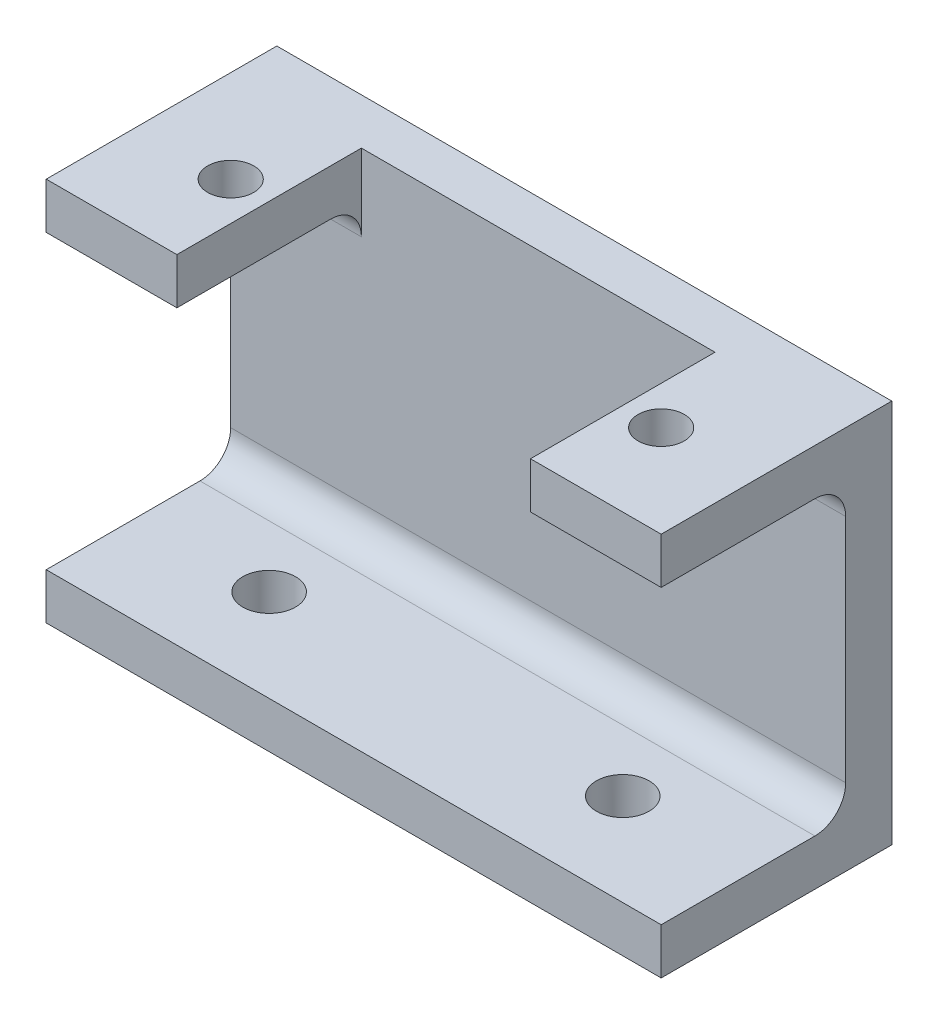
ISO-10303-21;
HEADER;
FILE_DESCRIPTION(('STEP AP214'),'2;1');
FILE_NAME('part.step','',(''),(''),'','','');
FILE_SCHEMA(('AUTOMOTIVE_DESIGN { 1 0 10303 214 1 1 1 1 }'));
ENDSEC;
DATA;
#1=APPLICATION_CONTEXT('core data for automotive mechanical design processes');
#2=APPLICATION_PROTOCOL_DEFINITION('international standard','automotive_design',2000,#1);
#3=PRODUCT_CONTEXT('',#1,'mechanical');
#4=PRODUCT('Part','Part','',(#3));
#5=PRODUCT_RELATED_PRODUCT_CATEGORY('part','',(#4));
#6=PRODUCT_DEFINITION_FORMATION('','',#4);
#7=PRODUCT_DEFINITION_CONTEXT('part definition',#1,'design');
#8=PRODUCT_DEFINITION('design','',#6,#7);
#9=PRODUCT_DEFINITION_SHAPE('','',#8);
#10=(LENGTH_UNIT() NAMED_UNIT(*) SI_UNIT(.MILLI.,.METRE.));
#11=(NAMED_UNIT(*) PLANE_ANGLE_UNIT() SI_UNIT($,.RADIAN.));
#12=(NAMED_UNIT(*) SI_UNIT($,.STERADIAN.) SOLID_ANGLE_UNIT());
#13=UNCERTAINTY_MEASURE_WITH_UNIT(LENGTH_MEASURE(1.E-05),#10,'distance_accuracy_value','');
#14=(GEOMETRIC_REPRESENTATION_CONTEXT(3) GLOBAL_UNCERTAINTY_ASSIGNED_CONTEXT((#13)) GLOBAL_UNIT_ASSIGNED_CONTEXT((#10,
#11,#12)) REPRESENTATION_CONTEXT('',''));
#15=CARTESIAN_POINT('',(0.,0.,0.));
#16=DIRECTION('',(0.,0.,1.));
#17=DIRECTION('',(1.,0.,0.));
#18=AXIS2_PLACEMENT_3D('',#15,#16,#17);
#19=CARTESIAN_POINT('',(0.,0.,3.));
#20=DIRECTION('',(0.,0.,1.));
#21=DIRECTION('',(1.,0.,0.));
#22=AXIS2_PLACEMENT_3D('',#19,#20,#21);
#23=PLANE('',#22);
#24=DIRECTION('',(0.,1.,0.));
#25=VECTOR('',#24,1.);
#26=CARTESIAN_POINT('',(-10.6343963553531,12.5740318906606,3.));
#27=LINE('',#26,#25);
#28=CARTESIAN_POINT('',(-10.6343963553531,7.57403189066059,3.));
#29=VERTEX_POINT('',#28);
#30=CARTESIAN_POINT('',(-10.6343963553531,12.5740318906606,3.));
#31=VERTEX_POINT('',#30);
#32=EDGE_CURVE('E181',#29,#31,#27,.T.);
#33=ORIENTED_EDGE('',*,*,#32,.F.);
#34=DIRECTION('',(1.,0.,0.));
#35=VECTOR('',#34,1.);
#36=CARTESIAN_POINT('',(0.,7.57403189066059,3.));
#37=LINE('',#36,#35);
#38=CARTESIAN_POINT('',(-19.1343963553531,7.57403189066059,3.));
#39=VERTEX_POINT('',#38);
#40=EDGE_CURVE('E248',#29,#39,#37,.F.);
#41=ORIENTED_EDGE('',*,*,#40,.T.);
#42=DIRECTION('',(0.,-1.,0.));
#43=VECTOR('',#42,1.);
#44=CARTESIAN_POINT('',(-19.1343963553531,12.5740318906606,3.));
#45=LINE('',#44,#43);
#46=CARTESIAN_POINT('',(-19.1343963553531,-7.42596810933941,3.));
#47=VERTEX_POINT('',#46);
#48=EDGE_CURVE('E219',#39,#47,#45,.T.);
#49=ORIENTED_EDGE('',*,*,#48,.T.);
#50=DIRECTION('',(-1.,0.,0.));
#51=VECTOR('',#50,1.);
#52=CARTESIAN_POINT('',(0.,-7.42596810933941,3.));
#53=LINE('',#52,#51);
#54=CARTESIAN_POINT('',(20.8656036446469,-7.42596810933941,3.));
#55=VERTEX_POINT('',#54);
#56=EDGE_CURVE('E243',#47,#55,#53,.F.);
#57=ORIENTED_EDGE('',*,*,#56,.T.);
#58=DIRECTION('',(0.,1.,0.));
#59=VECTOR('',#58,1.);
#60=CARTESIAN_POINT('',(20.8656036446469,12.5740318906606,3.));
#61=LINE('',#60,#59);
#62=CARTESIAN_POINT('',(20.8656036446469,7.57403189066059,3.));
#63=VERTEX_POINT('',#62);
#64=EDGE_CURVE('E222',#55,#63,#61,.T.);
#65=ORIENTED_EDGE('',*,*,#64,.T.);
#66=DIRECTION('',(1.,0.,0.));
#67=VECTOR('',#66,1.);
#68=CARTESIAN_POINT('',(0.,7.5740318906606,3.));
#69=LINE('',#68,#67);
#70=CARTESIAN_POINT('',(12.3656036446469,7.57403189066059,3.));
#71=VERTEX_POINT('',#70);
#72=EDGE_CURVE('E245',#63,#71,#69,.F.);
#73=ORIENTED_EDGE('',*,*,#72,.T.);
#74=DIRECTION('',(0.,-1.,0.));
#75=VECTOR('',#74,1.);
#76=CARTESIAN_POINT('',(12.3656036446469,12.5740318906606,3.));
#77=LINE('',#76,#75);
#78=CARTESIAN_POINT('',(12.3656036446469,12.5740318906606,3.));
#79=VERTEX_POINT('',#78);
#80=EDGE_CURVE('E166',#79,#71,#77,.T.);
#81=ORIENTED_EDGE('',*,*,#80,.F.);
#82=DIRECTION('',(-1.,0.,0.));
#83=VECTOR('',#82,1.);
#84=CARTESIAN_POINT('',(-19.1343963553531,12.5740318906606,3.));
#85=LINE('',#84,#83);
#86=EDGE_CURVE('E226',#79,#31,#85,.T.);
#87=ORIENTED_EDGE('',*,*,#86,.T.);
#88=EDGE_LOOP('',(#33,#41,#49,#57,#65,#73,#81,#87));
#89=FACE_BOUND('',#88,.T.);
#90=ADVANCED_FACE('F33',(#89),#23,.T.);
#91=CARTESIAN_POINT('',(-19.1343963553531,12.5740318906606,3.));
#92=DIRECTION('',(1.,0.,0.));
#93=DIRECTION('',(0.,1.,0.));
#94=AXIS2_PLACEMENT_3D('',#91,#92,#93);
#95=PLANE('',#94);
#96=DIRECTION('',(0.,-1.,0.));
#97=VECTOR('',#96,1.);
#98=CARTESIAN_POINT('',(-19.1343963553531,12.5740318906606,0.));
#99=LINE('',#98,#97);
#100=CARTESIAN_POINT('',(-19.1343963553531,12.5740318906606,0.));
#101=VERTEX_POINT('',#100);
#102=CARTESIAN_POINT('',(-19.1343963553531,-12.4259681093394,0.));
#103=VERTEX_POINT('',#102);
#104=EDGE_CURVE('E218',#101,#103,#99,.T.);
#105=ORIENTED_EDGE('',*,*,#104,.T.);
#106=DIRECTION('',(0.,0.,-1.));
#107=VECTOR('',#106,1.);
#108=CARTESIAN_POINT('',(-19.1343963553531,-12.4259681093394,3.));
#109=LINE('',#108,#107);
#110=CARTESIAN_POINT('',(-19.1343963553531,-12.4259681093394,15.));
#111=VERTEX_POINT('',#110);
#112=EDGE_CURVE('E237',#111,#103,#109,.T.);
#113=ORIENTED_EDGE('',*,*,#112,.F.);
#114=DIRECTION('',(0.,-1.,0.));
#115=VECTOR('',#114,1.);
#116=CARTESIAN_POINT('',(-19.1343963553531,-12.4259681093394,15.));
#117=LINE('',#116,#115);
#118=CARTESIAN_POINT('',(-19.1343963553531,-9.42596810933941,15.));
#119=VERTEX_POINT('',#118);
#120=EDGE_CURVE('E203',#119,#111,#117,.T.);
#121=ORIENTED_EDGE('',*,*,#120,.F.);
#122=DIRECTION('',(0.,0.,-1.));
#123=VECTOR('',#122,1.);
#124=CARTESIAN_POINT('',(-19.1343963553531,-9.42596810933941,15.));
#125=LINE('',#124,#123);
#126=CARTESIAN_POINT('',(-19.1343963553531,-9.42596810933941,5.));
#127=VERTEX_POINT('',#126);
#128=EDGE_CURVE('E213',#119,#127,#125,.T.);
#129=ORIENTED_EDGE('',*,*,#128,.T.);
#130=CARTESIAN_POINT('',(-19.1343963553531,-7.42596810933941,5.));
#131=DIRECTION('',(1.,0.,0.));
#132=DIRECTION('',(0.,1.,0.));
#133=AXIS2_PLACEMENT_3D('',#130,#131,#132);
#134=CIRCLE('',#133,2.);
#135=EDGE_CURVE('E41',#127,#47,#134,.T.);
#136=ORIENTED_EDGE('',*,*,#135,.T.);
#137=ORIENTED_EDGE('',*,*,#48,.F.);
#138=CARTESIAN_POINT('',(-19.1343963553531,7.57403189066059,5.));
#139=DIRECTION('',(1.,0.,0.));
#140=DIRECTION('',(0.,1.,0.));
#141=AXIS2_PLACEMENT_3D('',#138,#139,#140);
#142=CIRCLE('',#141,2.);
#143=CARTESIAN_POINT('',(-19.1343963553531,9.57403189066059,5.));
#144=VERTEX_POINT('',#143);
#145=EDGE_CURVE('E258',#39,#144,#142,.T.);
#146=ORIENTED_EDGE('',*,*,#145,.T.);
#147=DIRECTION('',(0.,0.,-1.));
#148=VECTOR('',#147,1.);
#149=CARTESIAN_POINT('',(-19.1343963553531,9.57403189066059,15.));
#150=LINE('',#149,#148);
#151=CARTESIAN_POINT('',(-19.1343963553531,9.57403189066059,15.));
#152=VERTEX_POINT('',#151);
#153=EDGE_CURVE('E200',#152,#144,#150,.T.);
#154=ORIENTED_EDGE('',*,*,#153,.F.);
#155=DIRECTION('',(0.,-1.,0.));
#156=VECTOR('',#155,1.);
#157=CARTESIAN_POINT('',(-19.1343963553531,12.5740318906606,15.));
#158=LINE('',#157,#156);
#159=CARTESIAN_POINT('',(-19.1343963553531,12.5740318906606,15.));
#160=VERTEX_POINT('',#159);
#161=EDGE_CURVE('E182',#160,#152,#158,.T.);
#162=ORIENTED_EDGE('',*,*,#161,.F.);
#163=DIRECTION('',(0.,0.,-1.));
#164=VECTOR('',#163,1.);
#165=CARTESIAN_POINT('',(-19.1343963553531,12.5740318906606,3.));
#166=LINE('',#165,#164);
#167=EDGE_CURVE('E151',#160,#101,#166,.T.);
#168=ORIENTED_EDGE('',*,*,#167,.T.);
#169=EDGE_LOOP('',(#105,#113,#121,#129,#136,#137,#146,#154,#162,#168));
#170=FACE_BOUND('',#169,.T.);
#171=ADVANCED_FACE('F265',(#170),#95,.F.);
#172=CARTESIAN_POINT('',(-19.1343963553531,-12.4259681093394,3.));
#173=DIRECTION('',(0.,1.,0.));
#174=DIRECTION('',(0.,0.,1.));
#175=AXIS2_PLACEMENT_3D('',#172,#173,#174);
#176=PLANE('',#175);
#177=CARTESIAN_POINT('',(12.3656036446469,-12.4259681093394,9.));
#178=DIRECTION('',(0.,1.,0.));
#179=DIRECTION('',(0.,0.,1.));
#180=AXIS2_PLACEMENT_3D('',#177,#178,#179);
#181=CIRCLE('',#180,1.71646895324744);
#182=CARTESIAN_POINT('',(12.3656036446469,-12.4259681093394,10.7164689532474));
#183=VERTEX_POINT('',#182);
#184=EDGE_CURVE('E336',#183,#183,#181,.F.);
#185=ORIENTED_EDGE('',*,*,#184,.F.);
#186=EDGE_LOOP('',(#185));
#187=FACE_BOUND('',#186,.T.);
#188=CARTESIAN_POINT('',(-10.6343963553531,-12.4259681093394,9.));
#189=DIRECTION('',(0.,1.,0.));
#190=DIRECTION('',(0.,0.,1.));
#191=AXIS2_PLACEMENT_3D('',#188,#189,#190);
#192=CIRCLE('',#191,1.71646895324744);
#193=CARTESIAN_POINT('',(-10.6343963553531,-12.4259681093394,10.7164689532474));
#194=VERTEX_POINT('',#193);
#195=EDGE_CURVE('E168',#194,#194,#192,.F.);
#196=ORIENTED_EDGE('',*,*,#195,.F.);
#197=EDGE_LOOP('',(#196));
#198=FACE_BOUND('',#197,.T.);
#199=DIRECTION('',(1.,0.,0.));
#200=VECTOR('',#199,1.);
#201=CARTESIAN_POINT('',(-19.1343963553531,-12.4259681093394,0.));
#202=LINE('',#201,#200);
#203=CARTESIAN_POINT('',(20.8656036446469,-12.4259681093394,0.));
#204=VERTEX_POINT('',#203);
#205=EDGE_CURVE('E230',#103,#204,#202,.T.);
#206=ORIENTED_EDGE('',*,*,#205,.T.);
#207=DIRECTION('',(0.,0.,-1.));
#208=VECTOR('',#207,1.);
#209=CARTESIAN_POINT('',(20.8656036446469,-12.4259681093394,3.));
#210=LINE('',#209,#208);
#211=CARTESIAN_POINT('',(20.8656036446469,-12.4259681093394,15.));
#212=VERTEX_POINT('',#211);
#213=EDGE_CURVE('E150',#212,#204,#210,.T.);
#214=ORIENTED_EDGE('',*,*,#213,.F.);
#215=DIRECTION('',(1.,0.,0.));
#216=VECTOR('',#215,1.);
#217=CARTESIAN_POINT('',(-19.1343963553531,-12.4259681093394,15.));
#218=LINE('',#217,#216);
#219=EDGE_CURVE('E206',#111,#212,#218,.T.);
#220=ORIENTED_EDGE('',*,*,#219,.F.);
#221=ORIENTED_EDGE('',*,*,#112,.T.);
#222=EDGE_LOOP('',(#206,#214,#220,#221));
#223=FACE_BOUND('',#222,.T.);
#224=ADVANCED_FACE('F279',(#187,#198,#223),#176,.F.);
#225=CARTESIAN_POINT('',(20.8656036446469,12.5740318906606,3.));
#226=DIRECTION('',(-1.,0.,0.));
#227=DIRECTION('',(0.,-1.,0.));
#228=AXIS2_PLACEMENT_3D('',#225,#226,#227);
#229=PLANE('',#228);
#230=DIRECTION('',(0.,1.,0.));
#231=VECTOR('',#230,1.);
#232=CARTESIAN_POINT('',(20.8656036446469,12.5740318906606,0.));
#233=LINE('',#232,#231);
#234=CARTESIAN_POINT('',(20.8656036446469,12.5740318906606,0.));
#235=VERTEX_POINT('',#234);
#236=EDGE_CURVE('E147',#204,#235,#233,.T.);
#237=ORIENTED_EDGE('',*,*,#236,.T.);
#238=DIRECTION('',(0.,0.,-1.));
#239=VECTOR('',#238,1.);
#240=CARTESIAN_POINT('',(20.8656036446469,12.5740318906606,3.));
#241=LINE('',#240,#239);
#242=CARTESIAN_POINT('',(20.8656036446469,12.5740318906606,15.));
#243=VERTEX_POINT('',#242);
#244=EDGE_CURVE('E139',#243,#235,#241,.T.);
#245=ORIENTED_EDGE('',*,*,#244,.F.);
#246=DIRECTION('',(0.,1.,0.));
#247=VECTOR('',#246,1.);
#248=CARTESIAN_POINT('',(20.8656036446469,12.5740318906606,15.));
#249=LINE('',#248,#247);
#250=CARTESIAN_POINT('',(20.8656036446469,9.57403189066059,15.));
#251=VERTEX_POINT('',#250);
#252=EDGE_CURVE('E144',#251,#243,#249,.T.);
#253=ORIENTED_EDGE('',*,*,#252,.F.);
#254=DIRECTION('',(0.,0.,-1.));
#255=VECTOR('',#254,1.);
#256=CARTESIAN_POINT('',(20.8656036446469,9.57403189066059,15.));
#257=LINE('',#256,#255);
#258=CARTESIAN_POINT('',(20.8656036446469,9.57403189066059,5.));
#259=VERTEX_POINT('',#258);
#260=EDGE_CURVE('E174',#251,#259,#257,.T.);
#261=ORIENTED_EDGE('',*,*,#260,.T.);
#262=CARTESIAN_POINT('',(20.8656036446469,7.57403189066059,5.));
#263=DIRECTION('',(-1.,0.,0.));
#264=DIRECTION('',(0.,-1.,0.));
#265=AXIS2_PLACEMENT_3D('',#262,#263,#264);
#266=CIRCLE('',#265,2.);
#267=EDGE_CURVE('E260',#259,#63,#266,.T.);
#268=ORIENTED_EDGE('',*,*,#267,.T.);
#269=ORIENTED_EDGE('',*,*,#64,.F.);
#270=CARTESIAN_POINT('',(20.8656036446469,-7.42596810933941,5.));
#271=DIRECTION('',(-1.,0.,0.));
#272=DIRECTION('',(0.,-1.,0.));
#273=AXIS2_PLACEMENT_3D('',#270,#271,#272);
#274=CIRCLE('',#273,2.);
#275=CARTESIAN_POINT('',(20.8656036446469,-9.42596810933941,5.));
#276=VERTEX_POINT('',#275);
#277=EDGE_CURVE('E11',#55,#276,#274,.T.);
#278=ORIENTED_EDGE('',*,*,#277,.T.);
#279=DIRECTION('',(0.,0.,-1.));
#280=VECTOR('',#279,1.);
#281=CARTESIAN_POINT('',(20.8656036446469,-9.42596810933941,15.));
#282=LINE('',#281,#280);
#283=CARTESIAN_POINT('',(20.8656036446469,-9.42596810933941,15.));
#284=VERTEX_POINT('',#283);
#285=EDGE_CURVE('E216',#284,#276,#282,.T.);
#286=ORIENTED_EDGE('',*,*,#285,.F.);
#287=DIRECTION('',(0.,1.,0.));
#288=VECTOR('',#287,1.);
#289=CARTESIAN_POINT('',(20.8656036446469,-12.4259681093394,15.));
#290=LINE('',#289,#288);
#291=EDGE_CURVE('E209',#212,#284,#290,.T.);
#292=ORIENTED_EDGE('',*,*,#291,.F.);
#293=ORIENTED_EDGE('',*,*,#213,.T.);
#294=EDGE_LOOP('',(#237,#245,#253,#261,#268,#269,#278,#286,#292,#293));
#295=FACE_BOUND('',#294,.T.);
#296=ADVANCED_FACE('F141',(#295),#229,.F.);
#297=CARTESIAN_POINT('',(-19.1343963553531,12.5740318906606,3.));
#298=DIRECTION('',(0.,-1.,0.));
#299=DIRECTION('',(0.,0.,-1.));
#300=AXIS2_PLACEMENT_3D('',#297,#298,#299);
#301=PLANE('',#300);
#302=CARTESIAN_POINT('',(14.8656036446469,12.5740318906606,9.));
#303=DIRECTION('',(0.,1.,0.));
#304=DIRECTION('',(0.,0.,-1.));
#305=AXIS2_PLACEMENT_3D('',#302,#303,#304);
#306=CIRCLE('',#305,1.5);
#307=CARTESIAN_POINT('',(14.8656036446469,12.5740318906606,7.5));
#308=VERTEX_POINT('',#307);
#309=EDGE_CURVE('E356',#308,#308,#306,.T.);
#310=ORIENTED_EDGE('',*,*,#309,.F.);
#311=EDGE_LOOP('',(#310));
#312=FACE_BOUND('',#311,.T.);
#313=CARTESIAN_POINT('',(-13.1343963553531,12.5740318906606,9.));
#314=DIRECTION('',(0.,1.,0.));
#315=DIRECTION('',(0.,0.,1.));
#316=AXIS2_PLACEMENT_3D('',#313,#314,#315);
#317=CIRCLE('',#316,1.5);
#318=CARTESIAN_POINT('',(-13.1343963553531,12.5740318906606,10.5));
#319=VERTEX_POINT('',#318);
#320=EDGE_CURVE('E350',#319,#319,#317,.T.);
#321=ORIENTED_EDGE('',*,*,#320,.F.);
#322=EDGE_LOOP('',(#321));
#323=FACE_BOUND('',#322,.T.);
#324=DIRECTION('',(-1.,0.,0.));
#325=VECTOR('',#324,1.);
#326=CARTESIAN_POINT('',(-19.1343963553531,12.5740318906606,0.));
#327=LINE('',#326,#325);
#328=EDGE_CURVE('E223',#235,#101,#327,.T.);
#329=ORIENTED_EDGE('',*,*,#328,.T.);
#330=ORIENTED_EDGE('',*,*,#167,.F.);
#331=DIRECTION('',(-1.,0.,0.));
#332=VECTOR('',#331,1.);
#333=CARTESIAN_POINT('',(-19.1343963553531,12.5740318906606,15.));
#334=LINE('',#333,#332);
#335=CARTESIAN_POINT('',(-10.6343963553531,12.5740318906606,15.));
#336=VERTEX_POINT('',#335);
#337=EDGE_CURVE('E189',#336,#160,#334,.T.);
#338=ORIENTED_EDGE('',*,*,#337,.F.);
#339=DIRECTION('',(0.,0.,-1.));
#340=VECTOR('',#339,1.);
#341=CARTESIAN_POINT('',(-10.6343963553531,12.5740318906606,15.));
#342=LINE('',#341,#340);
#343=EDGE_CURVE('E192',#336,#31,#342,.T.);
#344=ORIENTED_EDGE('',*,*,#343,.T.);
#345=ORIENTED_EDGE('',*,*,#86,.F.);
#346=DIRECTION('',(0.,0.,-1.));
#347=VECTOR('',#346,1.);
#348=CARTESIAN_POINT('',(12.3656036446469,12.5740318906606,15.));
#349=LINE('',#348,#347);
#350=CARTESIAN_POINT('',(12.3656036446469,12.5740318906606,15.));
#351=VERTEX_POINT('',#350);
#352=EDGE_CURVE('E157',#351,#79,#349,.T.);
#353=ORIENTED_EDGE('',*,*,#352,.F.);
#354=DIRECTION('',(-1.,0.,0.));
#355=VECTOR('',#354,1.);
#356=CARTESIAN_POINT('',(20.8656036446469,12.5740318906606,15.));
#357=LINE('',#356,#355);
#358=EDGE_CURVE('E154',#243,#351,#357,.T.);
#359=ORIENTED_EDGE('',*,*,#358,.F.);
#360=ORIENTED_EDGE('',*,*,#244,.T.);
#361=EDGE_LOOP('',(#329,#330,#338,#344,#345,#353,#359,#360));
#362=FACE_BOUND('',#361,.T.);
#363=ADVANCED_FACE('F155',(#312,#323,#362),#301,.F.);
#364=CARTESIAN_POINT('',(0.,0.,0.));
#365=DIRECTION('',(0.,0.,1.));
#366=DIRECTION('',(1.,0.,0.));
#367=AXIS2_PLACEMENT_3D('',#364,#365,#366);
#368=PLANE('',#367);
#369=ORIENTED_EDGE('',*,*,#104,.F.);
#370=ORIENTED_EDGE('',*,*,#328,.F.);
#371=ORIENTED_EDGE('',*,*,#236,.F.);
#372=ORIENTED_EDGE('',*,*,#205,.F.);
#373=EDGE_LOOP('',(#369,#370,#371,#372));
#374=FACE_BOUND('',#373,.T.);
#375=ADVANCED_FACE('F282',(#374),#368,.F.);
#376=CARTESIAN_POINT('',(-19.1343963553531,-9.42596810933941,15.));
#377=DIRECTION('',(0.,-1.,0.));
#378=DIRECTION('',(0.,0.,-1.));
#379=AXIS2_PLACEMENT_3D('',#376,#377,#378);
#380=PLANE('',#379);
#381=CARTESIAN_POINT('',(12.3656036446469,-9.42596810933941,9.));
#382=DIRECTION('',(0.,1.,0.));
#383=DIRECTION('',(0.,0.,-1.));
#384=AXIS2_PLACEMENT_3D('',#381,#382,#383);
#385=CIRCLE('',#384,1.71646895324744);
#386=CARTESIAN_POINT('',(12.3656036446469,-9.42596810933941,7.28353104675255));
#387=VERTEX_POINT('',#386);
#388=EDGE_CURVE('E344',#387,#387,#385,.T.);
#389=ORIENTED_EDGE('',*,*,#388,.F.);
#390=EDGE_LOOP('',(#389));
#391=FACE_BOUND('',#390,.T.);
#392=CARTESIAN_POINT('',(-10.6343963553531,-9.42596810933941,9.));
#393=DIRECTION('',(0.,1.,0.));
#394=DIRECTION('',(0.,0.,1.));
#395=AXIS2_PLACEMENT_3D('',#392,#393,#394);
#396=CIRCLE('',#395,1.71646895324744);
#397=CARTESIAN_POINT('',(-10.6343963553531,-9.42596810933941,10.7164689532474));
#398=VERTEX_POINT('',#397);
#399=EDGE_CURVE('E340',#398,#398,#396,.T.);
#400=ORIENTED_EDGE('',*,*,#399,.F.);
#401=EDGE_LOOP('',(#400));
#402=FACE_BOUND('',#401,.T.);
#403=ORIENTED_EDGE('',*,*,#285,.T.);
#404=DIRECTION('',(-1.,0.,0.));
#405=VECTOR('',#404,1.);
#406=CARTESIAN_POINT('',(-19.1343963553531,-9.42596810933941,5.));
#407=LINE('',#406,#405);
#408=EDGE_CURVE('E253',#276,#127,#407,.T.);
#409=ORIENTED_EDGE('',*,*,#408,.T.);
#410=ORIENTED_EDGE('',*,*,#128,.F.);
#411=DIRECTION('',(-1.,0.,0.));
#412=VECTOR('',#411,1.);
#413=CARTESIAN_POINT('',(-19.1343963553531,-9.42596810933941,15.));
#414=LINE('',#413,#412);
#415=EDGE_CURVE('E211',#284,#119,#414,.T.);
#416=ORIENTED_EDGE('',*,*,#415,.F.);
#417=EDGE_LOOP('',(#403,#409,#410,#416));
#418=FACE_BOUND('',#417,.T.);
#419=ADVANCED_FACE('F272',(#391,#402,#418),#380,.F.);
#420=CARTESIAN_POINT('',(0.,0.,15.));
#421=DIRECTION('',(0.,0.,-1.));
#422=DIRECTION('',(-1.,0.,0.));
#423=AXIS2_PLACEMENT_3D('',#420,#421,#422);
#424=PLANE('',#423);
#425=ORIENTED_EDGE('',*,*,#120,.T.);
#426=ORIENTED_EDGE('',*,*,#219,.T.);
#427=ORIENTED_EDGE('',*,*,#291,.T.);
#428=ORIENTED_EDGE('',*,*,#415,.T.);
#429=EDGE_LOOP('',(#425,#426,#427,#428));
#430=FACE_BOUND('',#429,.T.);
#431=ADVANCED_FACE('F276',(#430),#424,.F.);
#432=CARTESIAN_POINT('',(-19.1343963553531,9.57403189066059,15.));
#433=DIRECTION('',(0.,1.,0.));
#434=DIRECTION('',(0.,0.,1.));
#435=AXIS2_PLACEMENT_3D('',#432,#433,#434);
#436=PLANE('',#435);
#437=CARTESIAN_POINT('',(-13.1343963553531,9.57403189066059,9.));
#438=DIRECTION('',(0.,1.,0.));
#439=DIRECTION('',(0.,0.,1.));
#440=AXIS2_PLACEMENT_3D('',#437,#438,#439);
#441=CIRCLE('',#440,1.5);
#442=CARTESIAN_POINT('',(-13.1343963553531,9.57403189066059,10.5));
#443=VERTEX_POINT('',#442);
#444=EDGE_CURVE('E349',#443,#443,#441,.F.);
#445=ORIENTED_EDGE('',*,*,#444,.F.);
#446=EDGE_LOOP('',(#445));
#447=FACE_BOUND('',#446,.T.);
#448=ORIENTED_EDGE('',*,*,#153,.T.);
#449=DIRECTION('',(1.,0.,0.));
#450=VECTOR('',#449,1.);
#451=CARTESIAN_POINT('',(-19.1343963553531,9.57403189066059,5.));
#452=LINE('',#451,#450);
#453=CARTESIAN_POINT('',(-10.6343963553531,9.57403189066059,5.));
#454=VERTEX_POINT('',#453);
#455=EDGE_CURVE('E240',#144,#454,#452,.T.);
#456=ORIENTED_EDGE('',*,*,#455,.T.);
#457=DIRECTION('',(0.,0.,-1.));
#458=VECTOR('',#457,1.);
#459=CARTESIAN_POINT('',(-10.6343963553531,9.57403189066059,15.));
#460=LINE('',#459,#458);
#461=CARTESIAN_POINT('',(-10.6343963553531,9.57403189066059,15.));
#462=VERTEX_POINT('',#461);
#463=EDGE_CURVE('E197',#462,#454,#460,.T.);
#464=ORIENTED_EDGE('',*,*,#463,.F.);
#465=DIRECTION('',(1.,0.,0.));
#466=VECTOR('',#465,1.);
#467=CARTESIAN_POINT('',(-19.1343963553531,9.57403189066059,15.));
#468=LINE('',#467,#466);
#469=EDGE_CURVE('E185',#152,#462,#468,.T.);
#470=ORIENTED_EDGE('',*,*,#469,.F.);
#471=EDGE_LOOP('',(#448,#456,#464,#470));
#472=FACE_BOUND('',#471,.T.);
#473=ADVANCED_FACE('F378',(#447,#472),#436,.F.);
#474=CARTESIAN_POINT('',(-10.6343963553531,12.5740318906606,15.));
#475=DIRECTION('',(-1.,0.,0.));
#476=DIRECTION('',(0.,0.,1.));
#477=AXIS2_PLACEMENT_3D('',#474,#475,#476);
#478=PLANE('',#477);
#479=ORIENTED_EDGE('',*,*,#32,.T.);
#480=ORIENTED_EDGE('',*,*,#343,.F.);
#481=DIRECTION('',(0.,1.,0.));
#482=VECTOR('',#481,1.);
#483=CARTESIAN_POINT('',(-10.6343963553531,12.5740318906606,15.));
#484=LINE('',#483,#482);
#485=EDGE_CURVE('E187',#462,#336,#484,.T.);
#486=ORIENTED_EDGE('',*,*,#485,.F.);
#487=ORIENTED_EDGE('',*,*,#463,.T.);
#488=CARTESIAN_POINT('',(-10.6343963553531,7.57403189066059,5.));
#489=DIRECTION('',(-1.,0.,0.));
#490=DIRECTION('',(0.,0.,1.));
#491=AXIS2_PLACEMENT_3D('',#488,#489,#490);
#492=CIRCLE('',#491,2.);
#493=EDGE_CURVE('E255',#454,#29,#492,.T.);
#494=ORIENTED_EDGE('',*,*,#493,.T.);
#495=EDGE_LOOP('',(#479,#480,#486,#487,#494));
#496=FACE_BOUND('',#495,.T.);
#497=ADVANCED_FACE('F293',(#496),#478,.F.);
#498=CARTESIAN_POINT('',(0.,0.,15.));
#499=DIRECTION('',(0.,0.,1.));
#500=DIRECTION('',(1.,0.,0.));
#501=AXIS2_PLACEMENT_3D('',#498,#499,#500);
#502=PLANE('',#501);
#503=ORIENTED_EDGE('',*,*,#161,.T.);
#504=ORIENTED_EDGE('',*,*,#469,.T.);
#505=ORIENTED_EDGE('',*,*,#485,.T.);
#506=ORIENTED_EDGE('',*,*,#337,.T.);
#507=EDGE_LOOP('',(#503,#504,#505,#506));
#508=FACE_BOUND('',#507,.T.);
#509=ADVANCED_FACE('F287',(#508),#502,.T.);
#510=CARTESIAN_POINT('',(12.3656036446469,12.5740318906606,15.));
#511=DIRECTION('',(1.,0.,0.));
#512=DIRECTION('',(0.,0.,-1.));
#513=AXIS2_PLACEMENT_3D('',#510,#511,#512);
#514=PLANE('',#513);
#515=ORIENTED_EDGE('',*,*,#80,.T.);
#516=CARTESIAN_POINT('',(12.3656036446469,7.57403189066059,5.));
#517=DIRECTION('',(1.,0.,0.));
#518=DIRECTION('',(0.,0.,-1.));
#519=AXIS2_PLACEMENT_3D('',#516,#517,#518);
#520=CIRCLE('',#519,2.);
#521=CARTESIAN_POINT('',(12.3656036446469,9.57403189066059,5.));
#522=VERTEX_POINT('',#521);
#523=EDGE_CURVE('E262',#71,#522,#520,.T.);
#524=ORIENTED_EDGE('',*,*,#523,.T.);
#525=DIRECTION('',(0.,0.,-1.));
#526=VECTOR('',#525,1.);
#527=CARTESIAN_POINT('',(12.3656036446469,9.57403189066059,15.));
#528=LINE('',#527,#526);
#529=CARTESIAN_POINT('',(12.3656036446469,9.57403189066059,15.));
#530=VERTEX_POINT('',#529);
#531=EDGE_CURVE('E177',#530,#522,#528,.T.);
#532=ORIENTED_EDGE('',*,*,#531,.F.);
#533=DIRECTION('',(0.,-1.,0.));
#534=VECTOR('',#533,1.);
#535=CARTESIAN_POINT('',(12.3656036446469,12.5740318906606,15.));
#536=LINE('',#535,#534);
#537=EDGE_CURVE('E160',#351,#530,#536,.T.);
#538=ORIENTED_EDGE('',*,*,#537,.F.);
#539=ORIENTED_EDGE('',*,*,#352,.T.);
#540=EDGE_LOOP('',(#515,#524,#532,#538,#539));
#541=FACE_BOUND('',#540,.T.);
#542=ADVANCED_FACE('F297',(#541),#514,.F.);
#543=CARTESIAN_POINT('',(20.8656036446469,9.57403189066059,15.));
#544=DIRECTION('',(0.,1.,0.));
#545=DIRECTION('',(-1.,0.,0.));
#546=AXIS2_PLACEMENT_3D('',#543,#544,#545);
#547=PLANE('',#546);
#548=CARTESIAN_POINT('',(14.8656036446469,9.57403189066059,9.));
#549=DIRECTION('',(0.,1.,0.));
#550=DIRECTION('',(-1.,0.,0.));
#551=AXIS2_PLACEMENT_3D('',#548,#549,#550);
#552=CIRCLE('',#551,1.5);
#553=CARTESIAN_POINT('',(13.3656036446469,9.57403189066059,9.));
#554=VERTEX_POINT('',#553);
#555=EDGE_CURVE('E353',#554,#554,#552,.F.);
#556=ORIENTED_EDGE('',*,*,#555,.F.);
#557=EDGE_LOOP('',(#556));
#558=FACE_BOUND('',#557,.T.);
#559=ORIENTED_EDGE('',*,*,#531,.T.);
#560=DIRECTION('',(1.,0.,0.));
#561=VECTOR('',#560,1.);
#562=CARTESIAN_POINT('',(20.8656036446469,9.57403189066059,5.));
#563=LINE('',#562,#561);
#564=EDGE_CURVE('E250',#522,#259,#563,.T.);
#565=ORIENTED_EDGE('',*,*,#564,.T.);
#566=ORIENTED_EDGE('',*,*,#260,.F.);
#567=DIRECTION('',(1.,0.,0.));
#568=VECTOR('',#567,1.);
#569=CARTESIAN_POINT('',(20.8656036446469,9.57403189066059,15.));
#570=LINE('',#569,#568);
#571=EDGE_CURVE('E164',#530,#251,#570,.T.);
#572=ORIENTED_EDGE('',*,*,#571,.F.);
#573=EDGE_LOOP('',(#559,#565,#566,#572));
#574=FACE_BOUND('',#573,.T.);
#575=ADVANCED_FACE('F301',(#558,#574),#547,.F.);
#576=CARTESIAN_POINT('',(0.,0.,15.));
#577=DIRECTION('',(0.,0.,-1.));
#578=DIRECTION('',(-1.,0.,0.));
#579=AXIS2_PLACEMENT_3D('',#576,#577,#578);
#580=PLANE('',#579);
#581=ORIENTED_EDGE('',*,*,#252,.T.);
#582=ORIENTED_EDGE('',*,*,#358,.T.);
#583=ORIENTED_EDGE('',*,*,#537,.T.);
#584=ORIENTED_EDGE('',*,*,#571,.T.);
#585=EDGE_LOOP('',(#581,#582,#583,#584));
#586=FACE_BOUND('',#585,.T.);
#587=ADVANCED_FACE('F162',(#586),#580,.F.);
#588=CARTESIAN_POINT('',(-10.6343963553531,-12.4269681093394,9.));
#589=DIRECTION('',(0.,1.,0.));
#590=DIRECTION('',(0.,0.,1.));
#591=AXIS2_PLACEMENT_3D('',#588,#589,#590);
#592=CYLINDRICAL_SURFACE('',#591,1.71646895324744);
#593=ORIENTED_EDGE('',*,*,#399,.T.);
#594=EDGE_LOOP('',(#593));
#595=FACE_BOUND('',#594,.T.);
#596=ORIENTED_EDGE('',*,*,#195,.T.);
#597=EDGE_LOOP('',(#596));
#598=FACE_BOUND('',#597,.T.);
#599=ADVANCED_FACE('F369',(#595,#598),#592,.F.);
#600=CARTESIAN_POINT('',(12.3656036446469,-12.4269681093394,9.));
#601=DIRECTION('',(0.,1.,0.));
#602=DIRECTION('',(0.,0.,1.));
#603=AXIS2_PLACEMENT_3D('',#600,#601,#602);
#604=CYLINDRICAL_SURFACE('',#603,1.71646895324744);
#605=ORIENTED_EDGE('',*,*,#388,.T.);
#606=EDGE_LOOP('',(#605));
#607=FACE_BOUND('',#606,.T.);
#608=ORIENTED_EDGE('',*,*,#184,.T.);
#609=EDGE_LOOP('',(#608));
#610=FACE_BOUND('',#609,.T.);
#611=ADVANCED_FACE('F391',(#607,#610),#604,.F.);
#612=CARTESIAN_POINT('',(-13.1343963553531,-12.4269681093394,9.));
#613=DIRECTION('',(0.,1.,0.));
#614=DIRECTION('',(0.,0.,1.));
#615=AXIS2_PLACEMENT_3D('',#612,#613,#614);
#616=CYLINDRICAL_SURFACE('',#615,1.5);
#617=ORIENTED_EDGE('',*,*,#320,.T.);
#618=EDGE_LOOP('',(#617));
#619=FACE_BOUND('',#618,.T.);
#620=ORIENTED_EDGE('',*,*,#444,.T.);
#621=EDGE_LOOP('',(#620));
#622=FACE_BOUND('',#621,.T.);
#623=ADVANCED_FACE('F394',(#619,#622),#616,.F.);
#624=CARTESIAN_POINT('',(14.8656036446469,-12.4269681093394,9.));
#625=DIRECTION('',(0.,1.,0.));
#626=DIRECTION('',(0.,0.,1.));
#627=AXIS2_PLACEMENT_3D('',#624,#625,#626);
#628=CYLINDRICAL_SURFACE('',#627,1.5);
#629=ORIENTED_EDGE('',*,*,#309,.T.);
#630=EDGE_LOOP('',(#629));
#631=FACE_BOUND('',#630,.T.);
#632=ORIENTED_EDGE('',*,*,#555,.T.);
#633=EDGE_LOOP('',(#632));
#634=FACE_BOUND('',#633,.T.);
#635=ADVANCED_FACE('F310',(#631,#634),#628,.F.);
#636=CARTESIAN_POINT('',(-19.1343963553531,7.57403189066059,5.));
#637=DIRECTION('',(1.,0.,0.));
#638=DIRECTION('',(0.,0.,-1.));
#639=AXIS2_PLACEMENT_3D('',#636,#637,#638);
#640=CYLINDRICAL_SURFACE('',#639,2.);
#641=ORIENTED_EDGE('',*,*,#145,.F.);
#642=ORIENTED_EDGE('',*,*,#40,.F.);
#643=ORIENTED_EDGE('',*,*,#493,.F.);
#644=ORIENTED_EDGE('',*,*,#455,.F.);
#645=EDGE_LOOP('',(#641,#642,#643,#644));
#646=FACE_BOUND('',#645,.T.);
#647=ADVANCED_FACE('F305',(#646),#640,.F.);
#648=CARTESIAN_POINT('',(20.8656036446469,7.57403189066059,5.));
#649=DIRECTION('',(1.,0.,0.));
#650=DIRECTION('',(0.,1.,0.));
#651=AXIS2_PLACEMENT_3D('',#648,#649,#650);
#652=CYLINDRICAL_SURFACE('',#651,2.);
#653=ORIENTED_EDGE('',*,*,#523,.F.);
#654=ORIENTED_EDGE('',*,*,#72,.F.);
#655=ORIENTED_EDGE('',*,*,#267,.F.);
#656=ORIENTED_EDGE('',*,*,#564,.F.);
#657=EDGE_LOOP('',(#653,#654,#655,#656));
#658=FACE_BOUND('',#657,.T.);
#659=ADVANCED_FACE('F303',(#658),#652,.F.);
#660=CARTESIAN_POINT('',(-19.1343963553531,-7.42596810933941,5.));
#661=DIRECTION('',(-1.,0.,0.));
#662=DIRECTION('',(0.,0.,1.));
#663=AXIS2_PLACEMENT_3D('',#660,#661,#662);
#664=CYLINDRICAL_SURFACE('',#663,2.);
#665=ORIENTED_EDGE('',*,*,#277,.F.);
#666=ORIENTED_EDGE('',*,*,#56,.F.);
#667=ORIENTED_EDGE('',*,*,#135,.F.);
#668=ORIENTED_EDGE('',*,*,#408,.F.);
#669=EDGE_LOOP('',(#665,#666,#667,#668));
#670=FACE_BOUND('',#669,.T.);
#671=ADVANCED_FACE('F35',(#670),#664,.F.);
#672=CLOSED_SHELL('',(#90,#171,#224,#296,#363,#375,#419,#431,#473,#497,#509,#542,#575,#587,#599,
#611,#623,#635,#647,#659,#671));
#673=MANIFOLD_SOLID_BREP('B2',#672);
#674=ADVANCED_BREP_SHAPE_REPRESENTATION('',(#18,#673),#14);
#675=SHAPE_DEFINITION_REPRESENTATION(#9,#674);
ENDSEC;
END-ISO-10303-21;
